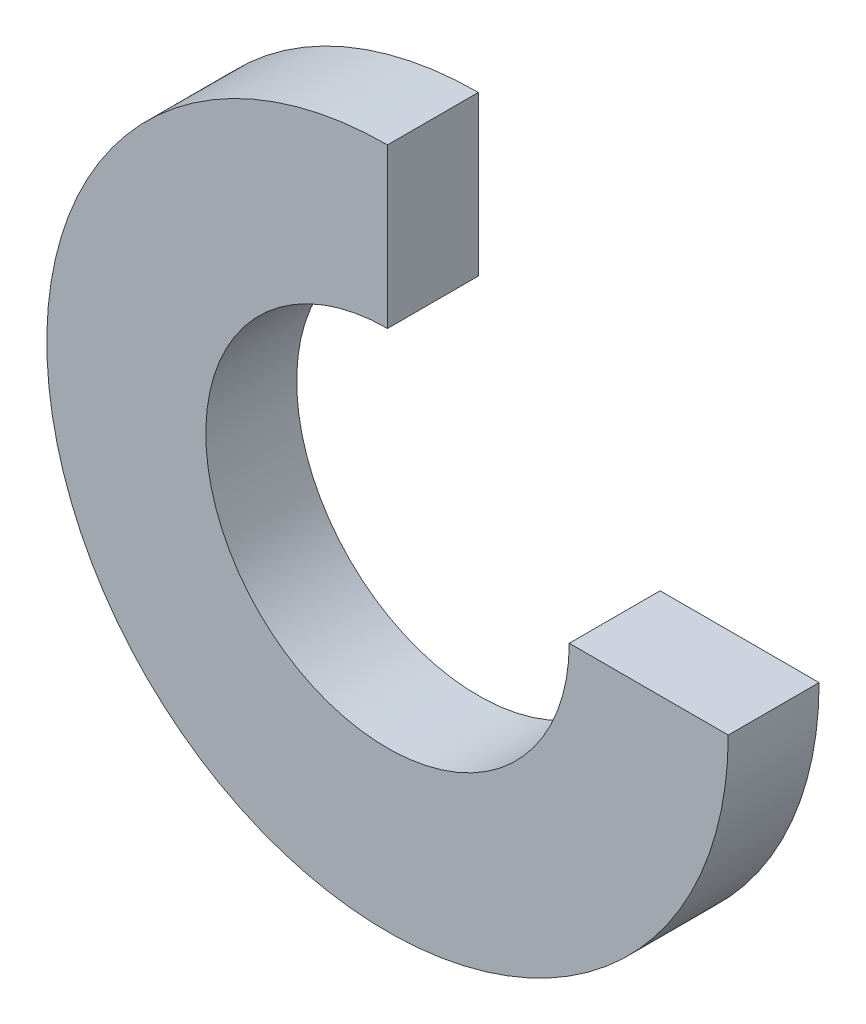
from build123d import *

# Parameters (mm, degrees)
BASE_EXTRUSION_DEPTH = 2


with BuildPart() as part:
    # Esquisse1 → Base-Extrusion (new body)
    with BuildSketch(Plane.XY):
        with BuildLine():
            Line((0, 4), (0, 7.5))
            ThreePointArc((0, 7.5), (-5.303300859, -5.303300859), (7.5, 0))
            Line((7.5, 0), (4, 0))
            ThreePointArc((4, 0), (-2.828427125, -2.828427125), (0, 4))
        make_face()
    extrude(amount=BASE_EXTRUSION_DEPTH)


solid = part.part
